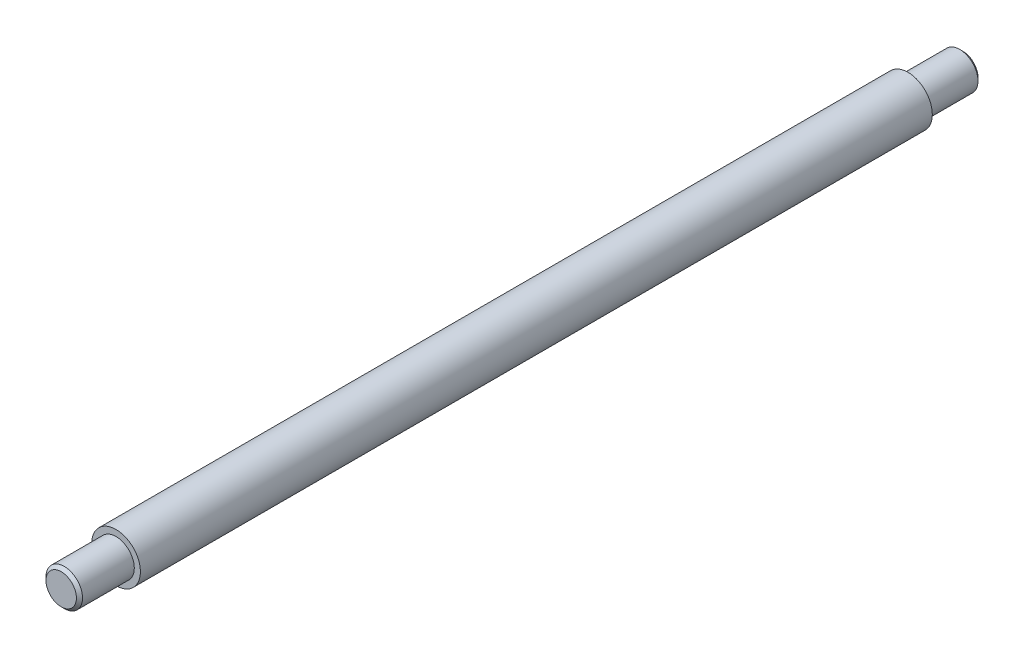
ISO-10303-21;
HEADER;
FILE_DESCRIPTION(('STEP AP214'),'2;1');
FILE_NAME('part.step','',(''),(''),'','','');
FILE_SCHEMA(('AUTOMOTIVE_DESIGN { 1 0 10303 214 1 1 1 1 }'));
ENDSEC;
DATA;
#1=APPLICATION_CONTEXT('core data for automotive mechanical design processes');
#2=APPLICATION_PROTOCOL_DEFINITION('international standard','automotive_design',2000,#1);
#3=PRODUCT_CONTEXT('',#1,'mechanical');
#4=PRODUCT('Part','Part','',(#3));
#5=PRODUCT_RELATED_PRODUCT_CATEGORY('part','',(#4));
#6=PRODUCT_DEFINITION_FORMATION('','',#4);
#7=PRODUCT_DEFINITION_CONTEXT('part definition',#1,'design');
#8=PRODUCT_DEFINITION('design','',#6,#7);
#9=PRODUCT_DEFINITION_SHAPE('','',#8);
#10=(LENGTH_UNIT() NAMED_UNIT(*) SI_UNIT(.MILLI.,.METRE.));
#11=(NAMED_UNIT(*) PLANE_ANGLE_UNIT() SI_UNIT($,.RADIAN.));
#12=(NAMED_UNIT(*) SI_UNIT($,.STERADIAN.) SOLID_ANGLE_UNIT());
#13=UNCERTAINTY_MEASURE_WITH_UNIT(LENGTH_MEASURE(1.E-05),#10,'distance_accuracy_value','');
#14=(GEOMETRIC_REPRESENTATION_CONTEXT(3) GLOBAL_UNCERTAINTY_ASSIGNED_CONTEXT((#13)) GLOBAL_UNIT_ASSIGNED_CONTEXT((#10,
#11,#12)) REPRESENTATION_CONTEXT('',''));
#15=CARTESIAN_POINT('',(0.,0.,0.));
#16=DIRECTION('',(0.,0.,1.));
#17=DIRECTION('',(1.,0.,0.));
#18=AXIS2_PLACEMENT_3D('',#15,#16,#17);
#19=CARTESIAN_POINT('',(0.,0.,65.));
#20=DIRECTION('',(0.,0.,-1.));
#21=DIRECTION('',(-0.999999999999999,0.,0.));
#22=AXIS2_PLACEMENT_3D('',#19,#20,#21);
#23=CYLINDRICAL_SURFACE('',#22,4.);
#24=CARTESIAN_POINT('',(0.,0.,65.));
#25=DIRECTION('',(0.,0.,1.));
#26=DIRECTION('',(0.999999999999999,0.,0.));
#27=AXIS2_PLACEMENT_3D('',#24,#25,#26);
#28=CIRCLE('',#27,4.);
#29=CARTESIAN_POINT('',(3.99999999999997,0.,65.));
#30=VERTEX_POINT('',#29);
#31=EDGE_CURVE('E52',#30,#30,#28,.T.);
#32=ORIENTED_EDGE('',*,*,#31,.F.);
#33=EDGE_LOOP('',(#32));
#34=FACE_BOUND('',#33,.T.);
#35=CARTESIAN_POINT('',(0.,0.,-65.));
#36=DIRECTION('',(0.,0.,1.));
#37=DIRECTION('',(0.999999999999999,0.,0.));
#38=AXIS2_PLACEMENT_3D('',#35,#36,#37);
#39=CIRCLE('',#38,4.);
#40=CARTESIAN_POINT('',(4.00000000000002,0.,-65.));
#41=VERTEX_POINT('',#40);
#42=EDGE_CURVE('E55',#41,#41,#39,.T.);
#43=ORIENTED_EDGE('',*,*,#42,.T.);
#44=EDGE_LOOP('',(#43));
#45=FACE_BOUND('',#44,.T.);
#46=ADVANCED_FACE('F32',(#34,#45),#23,.T.);
#47=CARTESIAN_POINT('',(0.,0.,65.));
#48=DIRECTION('',(0.,0.,1.));
#49=DIRECTION('',(0.999999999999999,0.,0.));
#50=AXIS2_PLACEMENT_3D('',#47,#48,#49);
#51=PLANE('',#50);
#52=CARTESIAN_POINT('',(0.,0.,65.));
#53=DIRECTION('',(0.,0.,1.));
#54=DIRECTION('',(0.999999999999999,0.,0.));
#55=AXIS2_PLACEMENT_3D('',#52,#53,#54);
#56=CIRCLE('',#55,3.);
#57=CARTESIAN_POINT('',(2.99999999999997,0.,65.));
#58=VERTEX_POINT('',#57);
#59=EDGE_CURVE('E51',#58,#58,#56,.T.);
#60=ORIENTED_EDGE('',*,*,#59,.F.);
#61=EDGE_LOOP('',(#60));
#62=FACE_BOUND('',#61,.T.);
#63=ORIENTED_EDGE('',*,*,#31,.T.);
#64=EDGE_LOOP('',(#63));
#65=FACE_BOUND('',#64,.T.);
#66=ADVANCED_FACE('F82',(#62,#65),#51,.T.);
#67=CARTESIAN_POINT('',(0.,0.,-65.));
#68=DIRECTION('',(0.,0.,1.));
#69=DIRECTION('',(0.999999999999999,0.,0.));
#70=AXIS2_PLACEMENT_3D('',#67,#68,#69);
#71=PLANE('',#70);
#72=CARTESIAN_POINT('',(0.,0.,-65.));
#73=DIRECTION('',(0.,0.,1.));
#74=DIRECTION('',(0.999999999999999,0.,0.));
#75=AXIS2_PLACEMENT_3D('',#72,#73,#74);
#76=CIRCLE('',#75,3.);
#77=CARTESIAN_POINT('',(3.00000000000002,0.,-65.));
#78=VERTEX_POINT('',#77);
#79=EDGE_CURVE('E58',#78,#78,#76,.T.);
#80=ORIENTED_EDGE('',*,*,#79,.T.);
#81=EDGE_LOOP('',(#80));
#82=FACE_BOUND('',#81,.T.);
#83=ORIENTED_EDGE('',*,*,#42,.F.);
#84=EDGE_LOOP('',(#83));
#85=FACE_BOUND('',#84,.T.);
#86=ADVANCED_FACE('F64',(#82,#85),#71,.F.);
#87=CARTESIAN_POINT('',(0.,0.,74.));
#88=DIRECTION('',(0.,0.,-1.));
#89=DIRECTION('',(-0.999999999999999,0.,0.));
#90=AXIS2_PLACEMENT_3D('',#87,#88,#89);
#91=CYLINDRICAL_SURFACE('',#90,3.);
#92=CARTESIAN_POINT('',(0.,0.,73.5));
#93=DIRECTION('',(0.,0.,1.));
#94=DIRECTION('',(0.999999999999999,0.,0.));
#95=AXIS2_PLACEMENT_3D('',#92,#93,#94);
#96=CIRCLE('',#95,3.);
#97=CARTESIAN_POINT('',(2.99999999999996,0.,73.5));
#98=VERTEX_POINT('',#97);
#99=EDGE_CURVE('E42',#98,#98,#96,.F.);
#100=ORIENTED_EDGE('',*,*,#99,.T.);
#101=EDGE_LOOP('',(#100));
#102=FACE_BOUND('',#101,.T.);
#103=ORIENTED_EDGE('',*,*,#59,.T.);
#104=EDGE_LOOP('',(#103));
#105=FACE_BOUND('',#104,.T.);
#106=ADVANCED_FACE('F92',(#102,#105),#91,.T.);
#107=CARTESIAN_POINT('',(0.,0.,74.));
#108=DIRECTION('',(0.,0.,1.));
#109=DIRECTION('',(0.999999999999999,0.,0.));
#110=AXIS2_PLACEMENT_3D('',#107,#108,#109);
#111=PLANE('',#110);
#112=CARTESIAN_POINT('',(0.,0.,74.));
#113=DIRECTION('',(0.,0.,1.));
#114=DIRECTION('',(0.999999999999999,0.,0.));
#115=AXIS2_PLACEMENT_3D('',#112,#113,#114);
#116=CIRCLE('',#115,2.49999999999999);
#117=CARTESIAN_POINT('',(2.49999999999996,0.,74.));
#118=VERTEX_POINT('',#117);
#119=EDGE_CURVE('E46',#118,#118,#116,.T.);
#120=ORIENTED_EDGE('',*,*,#119,.T.);
#121=EDGE_LOOP('',(#120));
#122=FACE_BOUND('',#121,.T.);
#123=ADVANCED_FACE('F78',(#122),#111,.T.);
#124=CARTESIAN_POINT('',(0.,0.,74.));
#125=DIRECTION('',(0.,0.,-1.));
#126=DIRECTION('',(-0.999999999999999,0.,0.));
#127=AXIS2_PLACEMENT_3D('',#124,#125,#126);
#128=CONICAL_SURFACE('',#127,2.49999999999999,0.785398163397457);
#129=ORIENTED_EDGE('',*,*,#99,.F.);
#130=EDGE_LOOP('',(#129));
#131=FACE_BOUND('',#130,.T.);
#132=ORIENTED_EDGE('',*,*,#119,.F.);
#133=EDGE_LOOP('',(#132));
#134=FACE_BOUND('',#133,.T.);
#135=ADVANCED_FACE('F70',(#131,#134),#128,.T.);
#136=CARTESIAN_POINT('',(0.,0.,-74.));
#137=DIRECTION('',(0.,0.,1.));
#138=DIRECTION('',(0.999999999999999,0.,0.));
#139=AXIS2_PLACEMENT_3D('',#136,#137,#138);
#140=CYLINDRICAL_SURFACE('',#139,3.);
#141=CARTESIAN_POINT('',(0.,0.,-73.5));
#142=DIRECTION('',(0.,0.,-1.));
#143=DIRECTION('',(-0.999999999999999,0.,0.));
#144=AXIS2_PLACEMENT_3D('',#141,#142,#143);
#145=CIRCLE('',#144,3.);
#146=CARTESIAN_POINT('',(-2.99999999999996,0.,-73.5));
#147=VERTEX_POINT('',#146);
#148=EDGE_CURVE('E38',#147,#147,#145,.F.);
#149=ORIENTED_EDGE('',*,*,#148,.T.);
#150=EDGE_LOOP('',(#149));
#151=FACE_BOUND('',#150,.T.);
#152=ORIENTED_EDGE('',*,*,#79,.F.);
#153=EDGE_LOOP('',(#152));
#154=FACE_BOUND('',#153,.T.);
#155=ADVANCED_FACE('F67',(#151,#154),#140,.T.);
#156=CARTESIAN_POINT('',(0.,0.,-74.));
#157=DIRECTION('',(0.,0.,-1.));
#158=DIRECTION('',(0.999999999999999,0.,0.));
#159=AXIS2_PLACEMENT_3D('',#156,#157,#158);
#160=PLANE('',#159);
#161=CARTESIAN_POINT('',(0.,0.,-74.));
#162=DIRECTION('',(0.,0.,-1.));
#163=DIRECTION('',(-0.999999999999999,0.,0.));
#164=AXIS2_PLACEMENT_3D('',#161,#162,#163);
#165=CIRCLE('',#164,2.49999999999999);
#166=CARTESIAN_POINT('',(-2.49999999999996,0.,-74.));
#167=VERTEX_POINT('',#166);
#168=EDGE_CURVE('E10',#167,#167,#165,.T.);
#169=ORIENTED_EDGE('',*,*,#168,.T.);
#170=EDGE_LOOP('',(#169));
#171=FACE_BOUND('',#170,.T.);
#172=ADVANCED_FACE('F69',(#171),#160,.T.);
#173=CARTESIAN_POINT('',(0.,0.,-73.5));
#174=DIRECTION('',(0.,0.,1.));
#175=DIRECTION('',(0.999999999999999,0.,0.));
#176=AXIS2_PLACEMENT_3D('',#173,#174,#175);
#177=CONICAL_SURFACE('',#176,3.,0.785398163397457);
#178=ORIENTED_EDGE('',*,*,#168,.F.);
#179=EDGE_LOOP('',(#178));
#180=FACE_BOUND('',#179,.T.);
#181=ORIENTED_EDGE('',*,*,#148,.F.);
#182=EDGE_LOOP('',(#181));
#183=FACE_BOUND('',#182,.T.);
#184=ADVANCED_FACE('F76',(#180,#183),#177,.T.);
#185=CLOSED_SHELL('',(#46,#66,#86,#106,#123,#135,#155,#172,#184));
#186=MANIFOLD_SOLID_BREP('B2',#185);
#187=ADVANCED_BREP_SHAPE_REPRESENTATION('',(#18,#186),#14);
#188=SHAPE_DEFINITION_REPRESENTATION(#9,#187);
ENDSEC;
END-ISO-10303-21;
